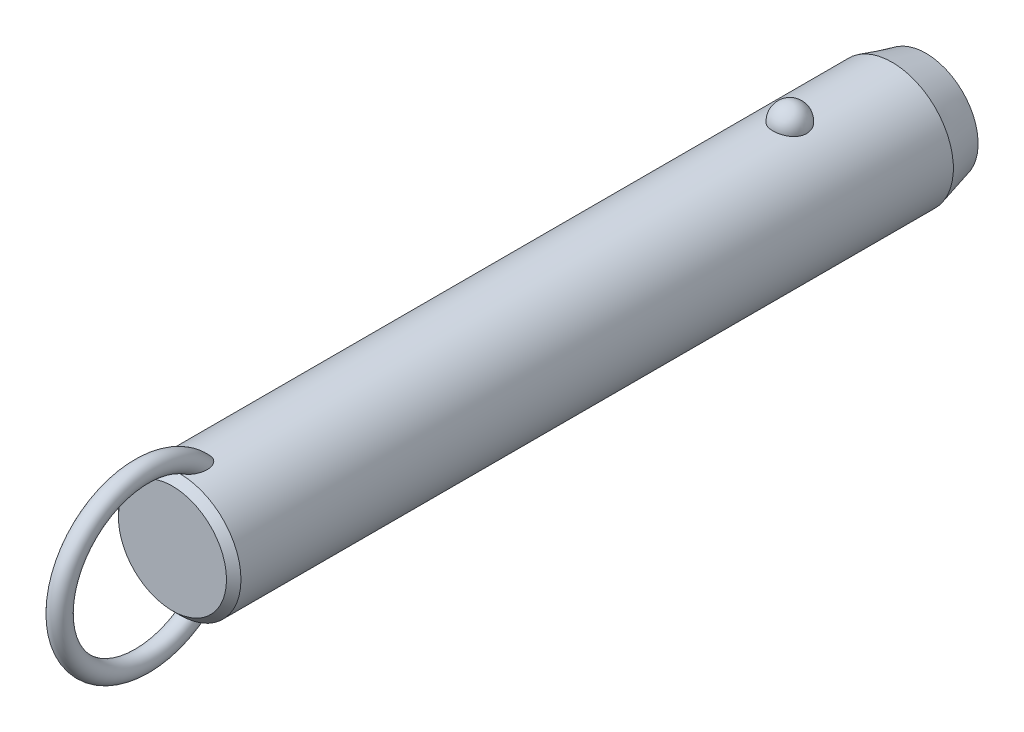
ISO-10303-21;
HEADER;
FILE_DESCRIPTION(('STEP AP214'),'2;1');
FILE_NAME('part.step','',(''),(''),'','','');
FILE_SCHEMA(('AUTOMOTIVE_DESIGN { 1 0 10303 214 1 1 1 1 }'));
ENDSEC;
DATA;
#1=APPLICATION_CONTEXT('core data for automotive mechanical design processes');
#2=APPLICATION_PROTOCOL_DEFINITION('international standard','automotive_design',2000,#1);
#3=PRODUCT_CONTEXT('',#1,'mechanical');
#4=PRODUCT('Part','Part','',(#3));
#5=PRODUCT_RELATED_PRODUCT_CATEGORY('part','',(#4));
#6=PRODUCT_DEFINITION_FORMATION('','',#4);
#7=PRODUCT_DEFINITION_CONTEXT('part definition',#1,'design');
#8=PRODUCT_DEFINITION('design','',#6,#7);
#9=PRODUCT_DEFINITION_SHAPE('','',#8);
#10=(LENGTH_UNIT() NAMED_UNIT(*) SI_UNIT(.MILLI.,.METRE.));
#11=(NAMED_UNIT(*) PLANE_ANGLE_UNIT() SI_UNIT($,.RADIAN.));
#12=(NAMED_UNIT(*) SI_UNIT($,.STERADIAN.) SOLID_ANGLE_UNIT());
#13=UNCERTAINTY_MEASURE_WITH_UNIT(LENGTH_MEASURE(1.E-05),#10,'distance_accuracy_value','');
#14=(GEOMETRIC_REPRESENTATION_CONTEXT(3) GLOBAL_UNCERTAINTY_ASSIGNED_CONTEXT((#13)) GLOBAL_UNIT_ASSIGNED_CONTEXT((#10,
#11,#12)) REPRESENTATION_CONTEXT('',''));
#15=CARTESIAN_POINT('',(0.,0.,0.));
#16=DIRECTION('',(0.,0.,1.));
#17=DIRECTION('',(1.,0.,0.));
#18=AXIS2_PLACEMENT_3D('',#15,#16,#17);
#19=CARTESIAN_POINT('',(0.,0.,111.8));
#20=DIRECTION('',(0.,0.,-1.));
#21=DIRECTION('',(-1.,0.,0.));
#22=AXIS2_PLACEMENT_3D('',#19,#20,#21);
#23=CYLINDRICAL_SURFACE('',#22,12.7);
#24=CARTESIAN_POINT('',(3.46661256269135,12.2177165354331,-3.5));
#25=CARTESIAN_POINT('',(3.4666090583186,12.2177194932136,-3.30432790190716));
#26=CARTESIAN_POINT('',(3.45063567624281,12.2222841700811,-3.10861112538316));
#27=CARTESIAN_POINT('',(3.38712451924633,12.2400345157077,-2.72271899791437));
#28=CARTESIAN_POINT('',(3.33957415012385,12.2532236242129,-2.53254588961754));
#29=CARTESIAN_POINT('',(3.2141234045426,12.286724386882,-2.16324948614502));
#30=CARTESIAN_POINT('',(3.13623639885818,12.3070329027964,-1.98412136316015));
#31=CARTESIAN_POINT('',(2.95205930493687,12.3525018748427,-1.64180592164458));
#32=CARTESIAN_POINT('',(2.84577003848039,12.3776621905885,-1.47861814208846));
#33=CARTESIAN_POINT('',(2.60688050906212,12.4301712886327,-1.17190583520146));
#34=CARTESIAN_POINT('',(2.47415697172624,12.4575299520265,-1.02847897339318));
#35=CARTESIAN_POINT('',(2.18615174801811,12.5112810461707,-0.766177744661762));
#36=CARTESIAN_POINT('',(2.03087002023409,12.5376734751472,-0.64730342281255));
#37=CARTESIAN_POINT('',(1.70237334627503,12.5864761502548,-0.437732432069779));
#38=CARTESIAN_POINT('',(1.52920948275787,12.6088972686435,-0.346958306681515));
#39=CARTESIAN_POINT('',(1.16944170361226,12.6473352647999,-0.195750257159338));
#40=CARTESIAN_POINT('',(0.982839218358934,12.663352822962,-0.135313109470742));
#41=CARTESIAN_POINT('',(0.604961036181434,12.6869706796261,-0.0473241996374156));
#42=CARTESIAN_POINT('',(0.41382314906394,12.6947125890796,-0.0192185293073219));
#43=CARTESIAN_POINT('',(0.0293827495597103,12.7014203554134,0.0051725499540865));
#44=CARTESIAN_POINT('',(-0.163919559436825,12.7003870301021,0.00146092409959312));
#45=CARTESIAN_POINT('',(-0.544374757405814,12.689735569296,-0.0373939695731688));
#46=CARTESIAN_POINT('',(-0.731575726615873,12.6802364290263,-0.0721015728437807));
#47=CARTESIAN_POINT('',(-1.09733277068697,12.6538333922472,-0.171364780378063));
#48=CARTESIAN_POINT('',(-1.27588869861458,12.6369293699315,-0.235920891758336));
#49=CARTESIAN_POINT('',(-1.6204698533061,12.5973946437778,-0.393548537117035));
#50=CARTESIAN_POINT('',(-1.78641865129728,12.5747321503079,-0.486778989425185));
#51=CARTESIAN_POINT('',(-2.10030671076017,12.5261316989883,-0.699110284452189));
#52=CARTESIAN_POINT('',(-2.24824419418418,12.5001934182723,-0.818213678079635));
#53=CARTESIAN_POINT('',(-2.52491489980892,12.4472906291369,-1.08157124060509));
#54=CARTESIAN_POINT('',(-2.65324222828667,12.4203160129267,-1.22624992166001));
#55=CARTESIAN_POINT('',(-2.88410007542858,12.3687509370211,-1.53528325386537));
#56=CARTESIAN_POINT('',(-2.98662883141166,12.3441606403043,-1.69963924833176));
#57=CARTESIAN_POINT('',(-3.16432417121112,12.2998199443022,-2.04548497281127));
#58=CARTESIAN_POINT('',(-3.23917525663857,12.2801261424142,-2.22714424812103));
#59=CARTESIAN_POINT('',(-3.35800573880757,12.248167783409,-2.6009138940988));
#60=CARTESIAN_POINT('',(-3.4019860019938,12.2359030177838,-2.79302397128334));
#61=CARTESIAN_POINT('',(-3.45784812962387,12.2202347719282,-3.18140279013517));
#62=CARTESIAN_POINT('',(-3.46986123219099,12.2167950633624,-3.37765118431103));
#63=CARTESIAN_POINT('',(-3.46186273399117,12.2190638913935,-3.76943689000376));
#64=CARTESIAN_POINT('',(-3.44185196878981,12.2247721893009,-3.96497421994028));
#65=CARTESIAN_POINT('',(-3.37048652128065,12.2446381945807,-4.34881728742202));
#66=CARTESIAN_POINT('',(-3.31928253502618,12.2587552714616,-4.53715319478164));
#67=CARTESIAN_POINT('',(-3.18693461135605,12.2938237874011,-4.90231727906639));
#68=CARTESIAN_POINT('',(-3.1057895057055,12.3147754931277,-5.07914500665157));
#69=CARTESIAN_POINT('',(-2.91506431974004,12.3613125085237,-5.41732059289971));
#70=CARTESIAN_POINT('',(-2.80533587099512,12.3869217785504,-5.57858147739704));
#71=CARTESIAN_POINT('',(-2.560414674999,12.4398525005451,-5.88013283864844));
#72=CARTESIAN_POINT('',(-2.42522099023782,12.4671740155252,-6.02042254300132));
#73=CARTESIAN_POINT('',(-2.1323357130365,12.5205965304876,-6.27662798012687));
#74=CARTESIAN_POINT('',(-1.97456596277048,12.5466928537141,-6.3924554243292));
#75=CARTESIAN_POINT('',(-1.64115839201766,12.5946384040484,-6.59583547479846));
#76=CARTESIAN_POINT('',(-1.46552179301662,12.6164879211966,-6.68339001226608));
#77=CARTESIAN_POINT('',(-1.10356050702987,12.6532533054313,-6.82682153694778));
#78=CARTESIAN_POINT('',(-0.9173913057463,12.6682500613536,-6.8830698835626));
#79=CARTESIAN_POINT('',(-0.537836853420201,12.6900288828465,-6.96386887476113));
#80=CARTESIAN_POINT('',(-0.344452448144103,12.6968119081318,-6.9884232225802));
#81=CARTESIAN_POINT('',(0.0402577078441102,12.7013667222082,-7.00496469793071));
#82=CARTESIAN_POINT('',(0.231556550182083,12.6993008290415,-6.99753844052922));
#83=CARTESIAN_POINT('',(0.610105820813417,12.6867505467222,-6.9516636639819));
#84=CARTESIAN_POINT('',(0.797356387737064,12.6762664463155,-6.913216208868));
#85=CARTESIAN_POINT('',(1.16186657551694,12.6480587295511,-6.80658431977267));
#86=CARTESIAN_POINT('',(1.33915951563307,12.6303611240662,-6.73850666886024));
#87=CARTESIAN_POINT('',(1.67968518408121,12.5896027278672,-6.5745087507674));
#88=CARTESIAN_POINT('',(1.84291705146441,12.5665416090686,-6.47858678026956));
#89=CARTESIAN_POINT('',(2.15340192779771,12.5171072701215,-6.25982455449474));
#90=CARTESIAN_POINT('',(2.30037831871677,12.4906895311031,-6.13660186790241));
#91=CARTESIAN_POINT('',(2.5717412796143,12.4376567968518,-5.86739587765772));
#92=CARTESIAN_POINT('',(2.69612388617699,12.4110417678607,-5.72140858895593));
#93=CARTESIAN_POINT('',(2.92107785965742,12.360051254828,-5.40794137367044));
#94=CARTESIAN_POINT('',(3.02121329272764,12.3357209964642,-5.24014110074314));
#95=CARTESIAN_POINT('',(3.19236291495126,12.2925446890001,-4.88969865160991));
#96=CARTESIAN_POINT('',(3.26338839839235,12.2736965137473,-4.70706226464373));
#97=CARTESIAN_POINT('',(3.36788038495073,12.245404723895,-4.35469510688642));
#98=CARTESIAN_POINT('',(3.40484026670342,12.2351018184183,-4.18605935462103));
#99=CARTESIAN_POINT('',(3.45420764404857,12.2212564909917,-3.84496058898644));
#100=CARTESIAN_POINT('',(3.46661565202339,12.2177139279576,-3.67249765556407));
#101=CARTESIAN_POINT('',(3.46661256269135,12.2177165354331,-3.5));
#102=B_SPLINE_CURVE_WITH_KNOTS('',3,(#24,#25,#26,#27,#28,#29,#30,#31,#32,#33,#34,#35,#36,#37,
#38,#39,#40,#41,#42,#43,#44,#45,#46,#47,#48,#49,#50,#51,#52,#53,#54,#55,#56,#57,#58,#59,#60,#61,
#62,#63,#64,#65,#66,#67,#68,#69,#70,#71,#72,#73,#74,#75,#76,#77,#78,#79,#80,#81,#82,#83,#84,#85,
#86,#87,#88,#89,#90,#91,#92,#93,#94,#95,#96,#97,#98,#99,#100,#101),.UNSPECIFIED.,.T.,.F.,(4,2,2,
2,2,2,2,2,2,2,2,2,2,2,2,2,2,2,2,2,2,2,2,2,2,2,2,2,2,2,2,2,2,2,2,2,2,2,4),(0.,0.586396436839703,
1.17302689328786,1.7593990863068,2.34575431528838,2.93491084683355,3.52406845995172,
4.11158733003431,4.69904375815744,5.2762784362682,5.85345931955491,6.42265312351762,
6.99185659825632,7.56427334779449,8.136746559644,8.71981013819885,9.3029135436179,
9.89247258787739,10.4820150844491,11.0691335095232,11.6562366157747,12.2405256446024,
12.8248374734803,13.412244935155,13.9996740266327,14.5891883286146,15.1786623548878,
15.7609861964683,16.3432419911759,16.9148635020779,17.4864654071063,18.0560241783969,
18.6256177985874,19.2037609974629,19.7820055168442,20.3699810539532,20.957728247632,
21.4746855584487,21.9916320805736),.UNSPECIFIED.);
#103=CARTESIAN_POINT('',(3.46661256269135,12.2177165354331,-3.5));
#104=VERTEX_POINT('',#103);
#105=EDGE_CURVE('E41',#104,#104,#102,.T.);
#106=ORIENTED_EDGE('',*,*,#105,.T.);
#107=EDGE_LOOP('',(#106));
#108=FACE_BOUND('',#107,.T.);
#109=CARTESIAN_POINT('',(0.,0.,123.));
#110=DIRECTION('',(0.,0.,1.));
#111=DIRECTION('',(1.,0.,0.));
#112=AXIS2_PLACEMENT_3D('',#109,#110,#111);
#113=CIRCLE('',#112,12.7);
#114=CARTESIAN_POINT('',(12.7,0.,123.));
#115=VERTEX_POINT('',#114);
#116=EDGE_CURVE('E10',#115,#115,#113,.F.);
#117=ORIENTED_EDGE('',*,*,#116,.T.);
#118=EDGE_LOOP('',(#117));
#119=FACE_BOUND('',#118,.T.);
#120=CARTESIAN_POINT('',(-0.548122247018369,-12.6881662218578,116.743218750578));
#121=CARTESIAN_POINT('',(-0.648865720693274,-12.6838128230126,116.777926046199));
#122=CARTESIAN_POINT('',(-0.746398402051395,-12.6783867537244,116.822042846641));
#123=CARTESIAN_POINT('',(-0.932125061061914,-12.666091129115,116.926764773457));
#124=CARTESIAN_POINT('',(-1.02030388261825,-12.6592192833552,116.987396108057));
#125=CARTESIAN_POINT('',(-1.18487740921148,-12.6448747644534,117.121847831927));
#126=CARTESIAN_POINT('',(-1.26134296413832,-12.637406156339,117.195582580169));
#127=CARTESIAN_POINT('',(-1.40231200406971,-12.6225412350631,117.353604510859));
#128=CARTESIAN_POINT('',(-1.46681470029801,-12.6151449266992,117.43789238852));
#129=CARTESIAN_POINT('',(-1.60714786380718,-12.5981718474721,117.649657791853));
#130=CARTESIAN_POINT('',(-1.67725126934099,-12.588900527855,117.780962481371));
#131=CARTESIAN_POINT('',(-1.79536591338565,-12.5725964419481,118.053247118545));
#132=CARTESIAN_POINT('',(-1.84333535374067,-12.5655679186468,118.194244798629));
#133=CARTESIAN_POINT('',(-1.93422576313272,-12.5519624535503,118.537645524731));
#134=CARTESIAN_POINT('',(-1.96788773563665,-12.5466298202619,118.742557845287));
#135=CARTESIAN_POINT('',(-1.9941399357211,-12.542463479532,119.051760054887));
#136=CARTESIAN_POINT('',(-1.99883864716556,-12.5417153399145,119.155298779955));
#137=CARTESIAN_POINT('',(-2.00078003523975,-12.5414074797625,119.36245124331));
#138=CARTESIAN_POINT('',(-1.99802449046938,-12.5418474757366,119.466064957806));
#139=CARTESIAN_POINT('',(-1.98336733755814,-12.5441750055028,119.710320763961));
#140=CARTESIAN_POINT('',(-1.96851430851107,-12.5465291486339,119.850780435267));
#141=CARTESIAN_POINT('',(-1.92707089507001,-12.5529612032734,120.129960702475));
#142=CARTESIAN_POINT('',(-1.90047458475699,-12.5570399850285,120.268680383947));
#143=CARTESIAN_POINT('',(-1.8361912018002,-12.5666008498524,120.54341135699));
#144=CARTESIAN_POINT('',(-1.79850828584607,-12.57208240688,120.679423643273));
#145=CARTESIAN_POINT('',(-1.71223796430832,-12.5841228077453,120.947842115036));
#146=CARTESIAN_POINT('',(-1.66365679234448,-12.5906810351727,121.080250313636));
#147=CARTESIAN_POINT('',(-1.5780450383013,-12.6016176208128,121.28548877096));
#148=CARTESIAN_POINT('',(-1.54477252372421,-12.6057501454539,121.359914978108));
#149=CARTESIAN_POINT('',(-1.47424480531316,-12.6141930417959,121.506839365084));
#150=CARTESIAN_POINT('',(-1.43699041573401,-12.6185033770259,121.579337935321));
#151=CARTESIAN_POINT('',(-1.35825795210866,-12.6272207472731,121.721892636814));
#152=CARTESIAN_POINT('',(-1.31678520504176,-12.6316276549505,121.791951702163));
#153=CARTESIAN_POINT('',(-1.22917793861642,-12.6404532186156,121.929070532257));
#154=CARTESIAN_POINT('',(-1.18304514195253,-12.6448718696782,121.996131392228));
#155=CARTESIAN_POINT('',(-1.0724641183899,-12.6547893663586,122.143874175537));
#156=CARTESIAN_POINT('',(-1.00642239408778,-12.6602600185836,122.223384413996));
#157=CARTESIAN_POINT('',(-0.864441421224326,-12.6707460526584,122.373169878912));
#158=CARTESIAN_POINT('',(-0.788516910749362,-12.6757620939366,122.443458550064));
#159=CARTESIAN_POINT('',(-0.652215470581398,-12.6833591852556,122.548680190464));
#160=CARTESIAN_POINT('',(-0.59498203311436,-12.6861973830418,122.587624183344));
#161=CARTESIAN_POINT('',(-0.475269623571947,-12.6912445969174,122.656489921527));
#162=CARTESIAN_POINT('',(-0.412800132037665,-12.6934547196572,122.686427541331));
#163=CARTESIAN_POINT('',(-0.295749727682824,-12.6966636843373,122.729756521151));
#164=CARTESIAN_POINT('',(-0.241949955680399,-12.6978134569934,122.745218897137));
#165=CARTESIAN_POINT('',(-0.132508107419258,-12.6994261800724,122.766884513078));
#166=CARTESIAN_POINT('',(-0.0768679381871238,-12.6998898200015,122.773097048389));
#167=CARTESIAN_POINT('',(0.0347696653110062,-12.7000752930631,122.775583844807));
#168=CARTESIAN_POINT('',(0.0907676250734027,-12.6997954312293,122.771835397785));
#169=CARTESIAN_POINT('',(0.201283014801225,-12.6985255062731,122.754788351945));
#170=CARTESIAN_POINT('',(0.255799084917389,-12.6975348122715,122.741481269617));
#171=CARTESIAN_POINT('',(0.37604233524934,-12.6946091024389,122.70203792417));
#172=CARTESIAN_POINT('',(0.4409508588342,-12.6924943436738,122.673449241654));
#173=CARTESIAN_POINT('',(0.565350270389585,-12.6875639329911,122.606323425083));
#174=CARTESIAN_POINT('',(0.624828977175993,-12.6847467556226,122.567764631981));
#175=CARTESIAN_POINT('',(0.774116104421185,-12.6767252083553,122.456949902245));
#176=CARTESIAN_POINT('',(0.859449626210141,-12.6711344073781,122.378760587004));
#177=CARTESIAN_POINT('',(1.01789440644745,-12.6593922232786,122.210943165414));
#178=CARTESIAN_POINT('',(1.09096902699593,-12.653239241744,122.121282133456));
#179=CARTESIAN_POINT('',(1.22268793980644,-12.6411674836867,121.940265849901));
#180=CARTESIAN_POINT('',(1.28193986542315,-12.6352572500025,121.849345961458));
#181=CARTESIAN_POINT('',(1.39259777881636,-12.6235401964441,121.662792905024));
#182=CARTESIAN_POINT('',(1.44399707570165,-12.6177334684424,121.567155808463));
#183=CARTESIAN_POINT('',(1.53972870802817,-12.6064093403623,121.372273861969));
#184=CARTESIAN_POINT('',(1.58405262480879,-12.6008922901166,121.273024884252));
#185=CARTESIAN_POINT('',(1.66600705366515,-12.5903187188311,121.071772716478));
#186=CARTESIAN_POINT('',(1.70363651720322,-12.5852622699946,120.969769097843));
#187=CARTESIAN_POINT('',(1.7754537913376,-12.5753406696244,120.754358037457));
#188=CARTESIAN_POINT('',(1.80903453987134,-12.5705328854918,120.640745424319));
#189=CARTESIAN_POINT('',(1.86844163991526,-12.5618400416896,120.411457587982));
#190=CARTESIAN_POINT('',(1.89426665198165,-12.5579551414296,120.295782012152));
#191=CARTESIAN_POINT('',(1.93785464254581,-12.5513030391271,120.063007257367));
#192=CARTESIAN_POINT('',(1.95562640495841,-12.5485346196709,119.945909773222));
#193=CARTESIAN_POINT('',(1.98264463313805,-12.5442934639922,119.710747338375));
#194=CARTESIAN_POINT('',(1.99189298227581,-12.5428204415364,119.59268260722));
#195=CARTESIAN_POINT('',(2.00416068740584,-12.540871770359,119.280622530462));
#196=CARTESIAN_POINT('',(1.99944433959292,-12.541631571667,119.086229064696));
#197=CARTESIAN_POINT('',(1.9611375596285,-12.5476846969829,118.700309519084));
#198=CARTESIAN_POINT('',(1.92758341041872,-12.5529723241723,118.508780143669));
#199=CARTESIAN_POINT('',(1.83934342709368,-12.5661532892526,118.182272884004));
#200=CARTESIAN_POINT('',(1.79215440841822,-12.5730485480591,118.04524997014));
#201=CARTESIAN_POINT('',(1.67676242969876,-12.588958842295,117.780445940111));
#202=CARTESIAN_POINT('',(1.60859050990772,-12.597970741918,117.652651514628));
#203=CARTESIAN_POINT('',(1.4658383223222,-12.6152829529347,117.435800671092));
#204=CARTESIAN_POINT('',(1.39525727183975,-12.6233659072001,117.34410500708));
#205=CARTESIAN_POINT('',(1.23992594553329,-12.6395676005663,117.173485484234));
#206=CARTESIAN_POINT('',(1.15517932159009,-12.6476863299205,117.094558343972));
#207=CARTESIAN_POINT('',(0.971995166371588,-12.6630846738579,116.952643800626));
#208=CARTESIAN_POINT('',(0.873456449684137,-12.6703572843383,116.889784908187));
#209=CARTESIAN_POINT('',(0.665847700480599,-12.6829569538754,116.784487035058));
#210=CARTESIAN_POINT('',(0.556784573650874,-12.688285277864,116.742034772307));
#211=CARTESIAN_POINT('',(0.3473384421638,-12.6956226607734,116.684443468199));
#212=CARTESIAN_POINT('',(0.24775974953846,-12.6979816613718,116.666399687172));
#213=CARTESIAN_POINT('',(0.0470218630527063,-12.7003077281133,116.648600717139));
#214=CARTESIAN_POINT('',(-0.0541350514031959,-12.7002779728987,116.648821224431));
#215=CARTESIAN_POINT('',(-0.221414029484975,-12.6982482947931,116.664363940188));
#216=CARTESIAN_POINT('',(-0.288055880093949,-12.6969033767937,116.674666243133));
#217=CARTESIAN_POINT('',(-0.419599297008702,-12.6932369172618,116.70313489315));
#218=CARTESIAN_POINT('',(-0.484501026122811,-12.6909154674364,116.721300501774));
#219=CARTESIAN_POINT('',(-0.548122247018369,-12.6881662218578,116.743218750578));
#220=B_SPLINE_CURVE_WITH_KNOTS('',3,(#120,#121,#122,#123,#124,#125,#126,#127,#128,#129,#130,
#131,#132,#133,#134,#135,#136,#137,#138,#139,#140,#141,#142,#143,#144,#145,#146,#147,#148,#149,
#150,#151,#152,#153,#154,#155,#156,#157,#158,#159,#160,#161,#162,#163,#164,#165,#166,#167,#168,
#169,#170,#171,#172,#173,#174,#175,#176,#177,#178,#179,#180,#181,#182,#183,#184,#185,#186,#187,
#188,#189,#190,#191,#192,#193,#194,#195,#196,#197,#198,#199,#200,#201,#202,#203,#204,#205,#206,
#207,#208,#209,#210,#211,#212,#213,#214,#215,#216,#217,#218,#219),.UNSPECIFIED.,.T.,.F.,(4,2,2,
2,2,2,2,2,2,2,2,2,2,2,2,2,2,2,2,2,2,2,2,2,2,2,2,2,2,2,2,2,2,2,2,2,2,2,2,2,2,2,2,2,2,2,2,2,2,4),
(0.,0.319642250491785,0.639794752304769,0.957927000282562,1.27608021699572,1.72100165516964,
2.16675988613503,2.78630021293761,3.0970578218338,3.40774128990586,3.83096358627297,
4.25439969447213,4.67767724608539,5.10071330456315,5.34550297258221,5.5902426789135,
5.83467707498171,6.07902143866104,6.38891080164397,6.69834321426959,6.90560910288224,
7.11250749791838,7.279773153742,7.44687060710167,7.61434932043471,7.78197685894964,
7.99365544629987,8.20579780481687,8.55147335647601,8.89816429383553,9.22375138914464,
9.54961437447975,9.87586224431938,10.202161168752,10.5575872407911,10.9130746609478,
11.2681734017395,11.6231936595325,12.2046601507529,12.7853961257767,13.2191642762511,
13.6522938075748,13.9989174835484,14.3454519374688,14.6946768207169,15.0436740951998,
15.3457513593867,15.647426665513,15.8493051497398,16.0511646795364),.UNSPECIFIED.);
#221=CARTESIAN_POINT('',(-0.548122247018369,-12.6881662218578,116.743218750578));
#222=VERTEX_POINT('',#221);
#223=EDGE_CURVE('E60',#222,#222,#220,.T.);
#224=ORIENTED_EDGE('',*,*,#223,.T.);
#225=EDGE_LOOP('',(#224));
#226=FACE_BOUND('',#225,.T.);
#227=CARTESIAN_POINT('',(-0.548122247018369,12.6881662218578,116.743218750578));
#228=CARTESIAN_POINT('',(-0.459436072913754,12.6919968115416,116.712673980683));
#229=CARTESIAN_POINT('',(-0.368189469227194,12.6949996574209,116.689391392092));
#230=CARTESIAN_POINT('',(-0.183024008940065,12.6990186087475,116.658406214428));
#231=CARTESIAN_POINT('',(-0.089104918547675,12.7000345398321,116.650704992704));
#232=CARTESIAN_POINT('',(0.0987147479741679,12.6999636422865,116.651245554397));
#233=CARTESIAN_POINT('',(0.192615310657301,12.6988761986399,116.659492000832));
#234=CARTESIAN_POINT('',(0.377658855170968,12.6947211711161,116.691551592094));
#235=CARTESIAN_POINT('',(0.468801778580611,12.6916535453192,116.715365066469));
#236=CARTESIAN_POINT('',(0.645809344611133,12.6838788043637,116.77745651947));
#237=CARTESIAN_POINT('',(0.731679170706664,12.6791733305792,116.815720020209));
#238=CARTESIAN_POINT('',(0.896315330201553,12.6686004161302,116.905120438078));
#239=CARTESIAN_POINT('',(0.975080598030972,12.6627328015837,116.956259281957));
#240=CARTESIAN_POINT('',(1.12963655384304,12.6499161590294,117.07367820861));
#241=CARTESIAN_POINT('',(1.20478673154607,12.6429194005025,117.140792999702));
#242=CARTESIAN_POINT('',(1.34448241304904,12.6288282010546,117.28522507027));
#243=CARTESIAN_POINT('',(1.40902173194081,12.621733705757,117.362548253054));
#244=CARTESIAN_POINT('',(1.55208211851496,12.6050877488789,117.559247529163));
#245=CARTESIAN_POINT('',(1.62510490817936,12.5957546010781,117.682654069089));
#246=CARTESIAN_POINT('',(1.75019044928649,12.5789823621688,117.939769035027));
#247=CARTESIAN_POINT('',(1.80221377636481,12.5715468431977,118.073496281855));
#248=CARTESIAN_POINT('',(1.90309965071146,12.5567434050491,118.398351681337));
#249=CARTESIAN_POINT('',(1.94342317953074,12.5504515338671,118.592161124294));
#250=CARTESIAN_POINT('',(1.99332997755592,12.5426147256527,118.98378810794));
#251=CARTESIAN_POINT('',(2.00285305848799,12.5410790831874,119.181612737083));
#252=CARTESIAN_POINT('',(1.99678999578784,12.5420407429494,119.516642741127));
#253=CARTESIAN_POINT('',(1.98794117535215,12.5434564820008,119.654042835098));
#254=CARTESIAN_POINT('',(1.95865119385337,12.5480641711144,119.927639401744));
#255=CARTESIAN_POINT('',(1.93820436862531,12.5512569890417,120.063835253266));
#256=CARTESIAN_POINT('',(1.88647896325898,12.5591352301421,120.334249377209));
#257=CARTESIAN_POINT('',(1.85518800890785,12.5638223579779,120.46846520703));
#258=CARTESIAN_POINT('',(1.78217886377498,12.5743868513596,120.733936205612));
#259=CARTESIAN_POINT('',(1.74046509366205,12.5802637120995,120.865192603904));
#260=CARTESIAN_POINT('',(1.66024095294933,12.5910571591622,121.086085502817));
#261=CARTESIAN_POINT('',(1.62434772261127,12.5957535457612,121.176690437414));
#262=CARTESIAN_POINT('',(1.5470900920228,12.6054762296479,121.355512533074));
#263=CARTESIAN_POINT('',(1.50572681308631,12.6105024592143,121.443730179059));
#264=CARTESIAN_POINT('',(1.4172802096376,12.620748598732,121.616932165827));
#265=CARTESIAN_POINT('',(1.37021377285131,12.625967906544,121.701925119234));
#266=CARTESIAN_POINT('',(1.26969620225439,12.6364721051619,121.868007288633));
#267=CARTESIAN_POINT('',(1.21624929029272,12.6417569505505,121.949099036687));
#268=CARTESIAN_POINT('',(1.10304413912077,12.6521331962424,122.104702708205));
#269=CARTESIAN_POINT('',(1.04340936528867,12.657226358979,122.179303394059));
#270=CARTESIAN_POINT('',(0.915919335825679,12.6670906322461,122.321324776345));
#271=CARTESIAN_POINT('',(0.848064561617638,12.6718617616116,122.388745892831));
#272=CARTESIAN_POINT('',(0.717035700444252,12.67987711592,122.500624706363));
#273=CARTESIAN_POINT('',(0.655526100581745,12.6832377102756,122.546997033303));
#274=CARTESIAN_POINT('',(0.525985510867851,12.6892676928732,122.629619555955));
#275=CARTESIAN_POINT('',(0.45796984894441,12.6919386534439,122.665892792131));
#276=CARTESIAN_POINT('',(0.334859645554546,12.695691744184,122.716657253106));
#277=CARTESIAN_POINT('',(0.281116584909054,12.6970073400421,122.734373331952));
#278=CARTESIAN_POINT('',(0.171425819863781,12.6989609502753,122.760642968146));
#279=CARTESIAN_POINT('',(0.115480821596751,12.699599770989,122.769207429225));
#280=CARTESIAN_POINT('',(0.00272618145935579,12.7001251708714,122.776253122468));
#281=CARTESIAN_POINT('',(-0.0540859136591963,12.7000089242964,122.774696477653));
#282=CARTESIAN_POINT('',(-0.166544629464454,12.6990328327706,122.761600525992));
#283=CARTESIAN_POINT('',(-0.222190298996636,12.6981724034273,122.750053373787));
#284=CARTESIAN_POINT('',(-0.342018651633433,12.695562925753,122.714912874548));
#285=CARTESIAN_POINT('',(-0.405606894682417,12.6936676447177,122.68933225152));
#286=CARTESIAN_POINT('',(-0.527815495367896,12.6891754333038,122.628311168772));
#287=CARTESIAN_POINT('',(-0.586425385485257,12.6865770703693,122.592850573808));
#288=CARTESIAN_POINT('',(-0.731842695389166,12.6792129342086,122.491496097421));
#289=CARTESIAN_POINT('',(-0.814709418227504,12.6740767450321,122.4200395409));
#290=CARTESIAN_POINT('',(-0.969101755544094,12.6632083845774,122.26589007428));
#291=CARTESIAN_POINT('',(-1.04059564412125,12.6574746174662,122.183166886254));
#292=CARTESIAN_POINT('',(-1.16981116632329,12.6461638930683,122.015809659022));
#293=CARTESIAN_POINT('',(-1.22811369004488,12.6405994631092,121.931616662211));
#294=CARTESIAN_POINT('',(-1.33743405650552,12.6295007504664,121.758579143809));
#295=CARTESIAN_POINT('',(-1.38844577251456,12.6239664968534,121.669730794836));
#296=CARTESIAN_POINT('',(-1.48400702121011,12.6130898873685,121.488389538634));
#297=CARTESIAN_POINT('',(-1.52854232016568,12.6077479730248,121.395889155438));
#298=CARTESIAN_POINT('',(-1.6115011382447,12.5974127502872,121.208160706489));
#299=CARTESIAN_POINT('',(-1.64992317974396,12.5924195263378,121.112931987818));
#300=CARTESIAN_POINT('',(-1.73468589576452,12.581070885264,120.88289362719));
#301=CARTESIAN_POINT('',(-1.77831261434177,12.5749388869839,120.747066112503));
#302=CARTESIAN_POINT('',(-1.85439734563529,12.5639437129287,120.472212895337));
#303=CARTESIAN_POINT('',(-1.88684994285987,12.5590811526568,120.333185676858));
#304=CARTESIAN_POINT('',(-1.9400848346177,12.550968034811,120.05309235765));
#305=CARTESIAN_POINT('',(-1.96088706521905,12.5477147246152,119.912030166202));
#306=CARTESIAN_POINT('',(-1.99000539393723,12.5431291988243,119.628668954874));
#307=CARTESIAN_POINT('',(-1.99832911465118,12.5417958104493,119.486370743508));
#308=CARTESIAN_POINT('',(-2.00166624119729,12.5412674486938,119.157627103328));
#309=CARTESIAN_POINT('',(-1.99178843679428,12.5428579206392,118.971088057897));
#310=CARTESIAN_POINT('',(-1.9445518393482,12.5502731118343,118.60162404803));
#311=CARTESIAN_POINT('',(-1.90724032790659,12.5560905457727,118.418693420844));
#312=CARTESIAN_POINT('',(-1.81330718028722,12.5699462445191,118.104848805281));
#313=CARTESIAN_POINT('',(-1.76338820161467,12.5771273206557,117.971910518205));
#314=CARTESIAN_POINT('',(-1.64305018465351,12.593414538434,117.715681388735));
#315=CARTESIAN_POINT('',(-1.57265346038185,12.6025185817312,117.592380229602));
#316=CARTESIAN_POINT('',(-1.42634956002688,12.6198178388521,117.383564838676));
#317=CARTESIAN_POINT('',(-1.35423772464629,12.6278405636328,117.295384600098));
#318=CARTESIAN_POINT('',(-1.19645664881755,12.6437632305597,117.132107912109));
#319=CARTESIAN_POINT('',(-1.11080536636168,12.6516633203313,117.056994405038));
#320=CARTESIAN_POINT('',(-0.947219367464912,12.6648319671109,116.937811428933));
#321=CARTESIAN_POINT('',(-0.871624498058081,12.670300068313,116.890541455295));
#322=CARTESIAN_POINT('',(-0.714161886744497,12.6801492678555,116.8077413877));
#323=CARTESIAN_POINT('',(-0.632295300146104,12.684530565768,116.77220913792));
#324=CARTESIAN_POINT('',(-0.548122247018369,12.6881662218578,116.743218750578));
#325=B_SPLINE_CURVE_WITH_KNOTS('',3,(#227,#228,#229,#230,#231,#232,#233,#234,#235,#236,#237,
#238,#239,#240,#241,#242,#243,#244,#245,#246,#247,#248,#249,#250,#251,#252,#253,#254,#255,#256,
#257,#258,#259,#260,#261,#262,#263,#264,#265,#266,#267,#268,#269,#270,#271,#272,#273,#274,#275,
#276,#277,#278,#279,#280,#281,#282,#283,#284,#285,#286,#287,#288,#289,#290,#291,#292,#293,#294,
#295,#296,#297,#298,#299,#300,#301,#302,#303,#304,#305,#306,#307,#308,#309,#310,#311,#312,#313,
#314,#315,#316,#317,#318,#319,#320,#321,#322,#323,#324),.UNSPECIFIED.,.T.,.F.,(4,2,2,2,2,2,2,2,
2,2,2,2,2,2,2,2,2,2,2,2,2,2,2,2,2,2,2,2,2,2,2,2,2,2,2,2,2,2,2,2,2,2,2,2,2,2,2,2,4),(0.,
0.281328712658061,0.562682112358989,0.844117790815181,1.12555942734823,1.40671982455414,
1.68792232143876,1.98972294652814,2.2916988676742,2.72039860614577,3.14989948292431,
3.7408491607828,4.33295293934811,4.74554109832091,5.15833092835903,5.57159335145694,
5.98468079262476,6.27722775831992,6.56971484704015,6.86135609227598,7.15280542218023,
7.43927407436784,7.7257259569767,7.95635862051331,8.18646071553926,8.35559393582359,
8.52452541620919,8.69408946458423,8.86378678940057,9.06834348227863,9.27332014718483,
9.60010414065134,9.92778432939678,10.2350252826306,10.5425229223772,10.8506864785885,
11.1589244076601,11.5867893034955,12.0148612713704,12.4421984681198,12.8692745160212,
13.4279365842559,13.9856380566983,14.4107062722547,14.8353130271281,15.1765567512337,
15.5173516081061,15.7844129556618,16.051425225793),.UNSPECIFIED.);
#326=CARTESIAN_POINT('',(-0.548122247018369,12.6881662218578,116.743218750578));
#327=VERTEX_POINT('',#326);
#328=EDGE_CURVE('E68',#327,#327,#325,.T.);
#329=ORIENTED_EDGE('',*,*,#328,.T.);
#330=EDGE_LOOP('',(#329));
#331=FACE_BOUND('',#330,.T.);
#332=CARTESIAN_POINT('',(0.,0.,-24.6999999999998));
#333=DIRECTION('',(0.,0.,-1.));
#334=DIRECTION('',(-1.,0.,0.));
#335=AXIS2_PLACEMENT_3D('',#332,#333,#334);
#336=CIRCLE('',#335,12.7);
#337=CARTESIAN_POINT('',(-12.7,0.,-24.6999999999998));
#338=VERTEX_POINT('',#337);
#339=EDGE_CURVE('E57',#338,#338,#336,.F.);
#340=ORIENTED_EDGE('',*,*,#339,.T.);
#341=EDGE_LOOP('',(#340));
#342=FACE_BOUND('',#341,.T.);
#343=ADVANCED_FACE('F37',(#108,#119,#226,#331,#342),#23,.T.);
#344=CARTESIAN_POINT('',(0.,0.,-31.7));
#345=DIRECTION('',(0.,0.,-1.));
#346=DIRECTION('',(-1.,0.,0.));
#347=AXIS2_PLACEMENT_3D('',#344,#345,#346);
#348=PLANE('',#347);
#349=CARTESIAN_POINT('',(0.,0.,-31.7));
#350=DIRECTION('',(0.,0.,-1.));
#351=DIRECTION('',(-1.,0.,0.));
#352=AXIS2_PLACEMENT_3D('',#349,#350,#351);
#353=CIRCLE('',#352,10.8243556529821);
#354=CARTESIAN_POINT('',(-10.8243556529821,0.,-31.7));
#355=VERTEX_POINT('',#354);
#356=EDGE_CURVE('E67',#355,#355,#353,.T.);
#357=ORIENTED_EDGE('',*,*,#356,.T.);
#358=EDGE_LOOP('',(#357));
#359=FACE_BOUND('',#358,.T.);
#360=ADVANCED_FACE('F86',(#359),#348,.T.);
#361=CARTESIAN_POINT('',(0.,0.,-31.7));
#362=DIRECTION('',(0.,0.,1.));
#363=DIRECTION('',(1.,0.,0.));
#364=AXIS2_PLACEMENT_3D('',#361,#362,#363);
#365=CONICAL_SURFACE('',#364,10.8243556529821,0.261799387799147);
#366=ORIENTED_EDGE('',*,*,#339,.F.);
#367=EDGE_LOOP('',(#366));
#368=FACE_BOUND('',#367,.T.);
#369=ORIENTED_EDGE('',*,*,#356,.F.);
#370=EDGE_LOOP('',(#369));
#371=FACE_BOUND('',#370,.T.);
#372=ADVANCED_FACE('F84',(#368,#371),#365,.T.);
#373=CARTESIAN_POINT('',(0.,0.,124.5));
#374=DIRECTION('',(0.,0.,1.));
#375=DIRECTION('',(1.,0.,0.));
#376=AXIS2_PLACEMENT_3D('',#373,#374,#375);
#377=PLANE('',#376);
#378=CARTESIAN_POINT('',(0.,0.,124.5));
#379=DIRECTION('',(0.,0.,1.));
#380=DIRECTION('',(1.,0.,0.));
#381=AXIS2_PLACEMENT_3D('',#378,#379,#380);
#382=CIRCLE('',#381,11.2);
#383=CARTESIAN_POINT('',(11.2,0.,124.5));
#384=VERTEX_POINT('',#383);
#385=EDGE_CURVE('E50',#384,#384,#382,.T.);
#386=ORIENTED_EDGE('',*,*,#385,.T.);
#387=EDGE_LOOP('',(#386));
#388=FACE_BOUND('',#387,.T.);
#389=ADVANCED_FACE('F78',(#388),#377,.T.);
#390=CARTESIAN_POINT('',(0.,0.,130.85));
#391=DIRECTION('',(1.,0.,0.));
#392=DIRECTION('',(0.,0.,-1.));
#393=AXIS2_PLACEMENT_3D('',#390,#391,#392);
#394=TOROIDAL_SURFACE('',#393,17.05,2.);
#395=ORIENTED_EDGE('',*,*,#328,.F.);
#396=EDGE_LOOP('',(#395));
#397=FACE_BOUND('',#396,.T.);
#398=ORIENTED_EDGE('',*,*,#223,.F.);
#399=EDGE_LOOP('',(#398));
#400=FACE_BOUND('',#399,.T.);
#401=ADVANCED_FACE('F74',(#397,#400),#394,.T.);
#402=CARTESIAN_POINT('',(0.,0.,124.5));
#403=DIRECTION('',(0.,0.,-1.));
#404=DIRECTION('',(-1.,0.,0.));
#405=AXIS2_PLACEMENT_3D('',#402,#403,#404);
#406=CONICAL_SURFACE('',#405,11.2,0.785398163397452);
#407=ORIENTED_EDGE('',*,*,#116,.F.);
#408=EDGE_LOOP('',(#407));
#409=FACE_BOUND('',#408,.T.);
#410=ORIENTED_EDGE('',*,*,#385,.F.);
#411=EDGE_LOOP('',(#410));
#412=FACE_BOUND('',#411,.T.);
#413=ADVANCED_FACE('F39',(#409,#412),#406,.T.);
#414=CARTESIAN_POINT('',(0.,12.7,-3.5));
#415=DIRECTION('',(0.,1.,0.));
#416=DIRECTION('',(0.,0.,-1.));
#417=AXIS2_PLACEMENT_3D('',#414,#415,#416);
#418=SPHERICAL_SURFACE('',#417,3.5);
#419=ORIENTED_EDGE('',*,*,#105,.F.);
#420=EDGE_LOOP('',(#419));
#421=FACE_BOUND('',#420,.T.);
#422=ADVANCED_FACE('F80',(#421),#418,.T.);
#423=CLOSED_SHELL('',(#343,#360,#372,#389,#401,#413,#422));
#424=MANIFOLD_SOLID_BREP('B2',#423);
#425=ADVANCED_BREP_SHAPE_REPRESENTATION('',(#18,#424),#14);
#426=SHAPE_DEFINITION_REPRESENTATION(#9,#425);
ENDSEC;
END-ISO-10303-21;
